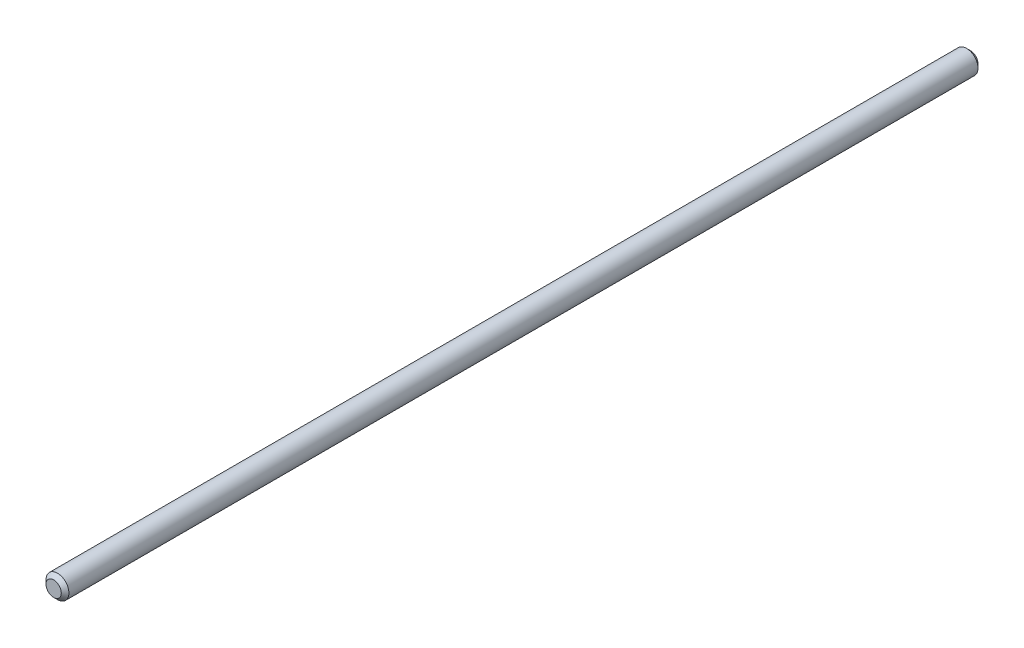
ISO-10303-21;
HEADER;
FILE_DESCRIPTION(('STEP AP214'),'2;1');
FILE_NAME('part.step','',(''),(''),'','','');
FILE_SCHEMA(('AUTOMOTIVE_DESIGN { 1 0 10303 214 1 1 1 1 }'));
ENDSEC;
DATA;
#1=APPLICATION_CONTEXT('core data for automotive mechanical design processes');
#2=APPLICATION_PROTOCOL_DEFINITION('international standard','automotive_design',2000,#1);
#3=PRODUCT_CONTEXT('',#1,'mechanical');
#4=PRODUCT('Part','Part','',(#3));
#5=PRODUCT_RELATED_PRODUCT_CATEGORY('part','',(#4));
#6=PRODUCT_DEFINITION_FORMATION('','',#4);
#7=PRODUCT_DEFINITION_CONTEXT('part definition',#1,'design');
#8=PRODUCT_DEFINITION('design','',#6,#7);
#9=PRODUCT_DEFINITION_SHAPE('','',#8);
#10=(LENGTH_UNIT() NAMED_UNIT(*) SI_UNIT(.MILLI.,.METRE.));
#11=(NAMED_UNIT(*) PLANE_ANGLE_UNIT() SI_UNIT($,.RADIAN.));
#12=(NAMED_UNIT(*) SI_UNIT($,.STERADIAN.) SOLID_ANGLE_UNIT());
#13=UNCERTAINTY_MEASURE_WITH_UNIT(LENGTH_MEASURE(1.E-05),#10,'distance_accuracy_value','');
#14=(GEOMETRIC_REPRESENTATION_CONTEXT(3) GLOBAL_UNCERTAINTY_ASSIGNED_CONTEXT((#13)) GLOBAL_UNIT_ASSIGNED_CONTEXT((#10,
#11,#12)) REPRESENTATION_CONTEXT('',''));
#15=CARTESIAN_POINT('',(0.,0.,0.));
#16=DIRECTION('',(0.,0.,1.));
#17=DIRECTION('',(1.,0.,0.));
#18=AXIS2_PLACEMENT_3D('',#15,#16,#17);
#19=CARTESIAN_POINT('',(0.,0.,120.));
#20=DIRECTION('',(0.,0.,-1.));
#21=DIRECTION('',(-1.,0.,0.));
#22=AXIS2_PLACEMENT_3D('',#19,#20,#21);
#23=CYLINDRICAL_SURFACE('',#22,1.5);
#24=CARTESIAN_POINT('',(0.,0.,119.5));
#25=DIRECTION('',(0.,0.,1.));
#26=DIRECTION('',(1.,0.,0.));
#27=AXIS2_PLACEMENT_3D('',#24,#25,#26);
#28=CIRCLE('',#27,1.5);
#29=CARTESIAN_POINT('',(1.5,0.,119.5));
#30=VERTEX_POINT('',#29);
#31=EDGE_CURVE('E33',#30,#30,#28,.F.);
#32=ORIENTED_EDGE('',*,*,#31,.T.);
#33=EDGE_LOOP('',(#32));
#34=FACE_BOUND('',#33,.T.);
#35=CARTESIAN_POINT('',(0.,0.,0.500000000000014));
#36=DIRECTION('',(0.,0.,1.));
#37=DIRECTION('',(1.,0.,0.));
#38=AXIS2_PLACEMENT_3D('',#35,#36,#37);
#39=CIRCLE('',#38,1.5);
#40=CARTESIAN_POINT('',(1.5,0.,0.500000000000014));
#41=VERTEX_POINT('',#40);
#42=EDGE_CURVE('E37',#41,#41,#39,.T.);
#43=ORIENTED_EDGE('',*,*,#42,.T.);
#44=EDGE_LOOP('',(#43));
#45=FACE_BOUND('',#44,.T.);
#46=ADVANCED_FACE('F27',(#34,#45),#23,.T.);
#47=CARTESIAN_POINT('',(0.,0.,120.));
#48=DIRECTION('',(0.,0.,1.));
#49=DIRECTION('',(1.,0.,0.));
#50=AXIS2_PLACEMENT_3D('',#47,#48,#49);
#51=PLANE('',#50);
#52=CARTESIAN_POINT('',(0.,0.,120.));
#53=DIRECTION('',(0.,0.,1.));
#54=DIRECTION('',(1.,0.,0.));
#55=AXIS2_PLACEMENT_3D('',#52,#53,#54);
#56=CIRCLE('',#55,0.999999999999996);
#57=CARTESIAN_POINT('',(0.999999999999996,0.,120.));
#58=VERTEX_POINT('',#57);
#59=EDGE_CURVE('E41',#58,#58,#56,.T.);
#60=ORIENTED_EDGE('',*,*,#59,.T.);
#61=EDGE_LOOP('',(#60));
#62=FACE_BOUND('',#61,.T.);
#63=ADVANCED_FACE('F47',(#62),#51,.T.);
#64=CARTESIAN_POINT('',(0.,0.,0.));
#65=DIRECTION('',(0.,0.,1.));
#66=DIRECTION('',(1.,0.,0.));
#67=AXIS2_PLACEMENT_3D('',#64,#65,#66);
#68=PLANE('',#67);
#69=CARTESIAN_POINT('',(0.,0.,0.));
#70=DIRECTION('',(0.,0.,1.));
#71=DIRECTION('',(1.,0.,0.));
#72=AXIS2_PLACEMENT_3D('',#69,#70,#71);
#73=CIRCLE('',#72,0.999999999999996);
#74=CARTESIAN_POINT('',(0.999999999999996,0.,0.));
#75=VERTEX_POINT('',#74);
#76=EDGE_CURVE('E10',#75,#75,#73,.F.);
#77=ORIENTED_EDGE('',*,*,#76,.T.);
#78=EDGE_LOOP('',(#77));
#79=FACE_BOUND('',#78,.T.);
#80=ADVANCED_FACE('F52',(#79),#68,.F.);
#81=CARTESIAN_POINT('',(0.,0.,120.));
#82=DIRECTION('',(0.,0.,-1.));
#83=DIRECTION('',(-1.,0.,0.));
#84=AXIS2_PLACEMENT_3D('',#81,#82,#83);
#85=CONICAL_SURFACE('',#84,0.999999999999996,0.785398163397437);
#86=ORIENTED_EDGE('',*,*,#31,.F.);
#87=EDGE_LOOP('',(#86));
#88=FACE_BOUND('',#87,.T.);
#89=ORIENTED_EDGE('',*,*,#59,.F.);
#90=EDGE_LOOP('',(#89));
#91=FACE_BOUND('',#90,.T.);
#92=ADVANCED_FACE('F49',(#88,#91),#85,.T.);
#93=CARTESIAN_POINT('',(0.,0.,0.500000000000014));
#94=DIRECTION('',(0.,0.,1.));
#95=DIRECTION('',(1.,0.,0.));
#96=AXIS2_PLACEMENT_3D('',#93,#94,#95);
#97=CONICAL_SURFACE('',#96,1.5,0.785398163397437);
#98=ORIENTED_EDGE('',*,*,#76,.F.);
#99=EDGE_LOOP('',(#98));
#100=FACE_BOUND('',#99,.T.);
#101=ORIENTED_EDGE('',*,*,#42,.F.);
#102=EDGE_LOOP('',(#101));
#103=FACE_BOUND('',#102,.T.);
#104=ADVANCED_FACE('F51',(#100,#103),#97,.T.);
#105=CLOSED_SHELL('',(#46,#63,#80,#92,#104));
#106=MANIFOLD_SOLID_BREP('B2',#105);
#107=ADVANCED_BREP_SHAPE_REPRESENTATION('',(#18,#106),#14);
#108=SHAPE_DEFINITION_REPRESENTATION(#9,#107);
ENDSEC;
END-ISO-10303-21;
